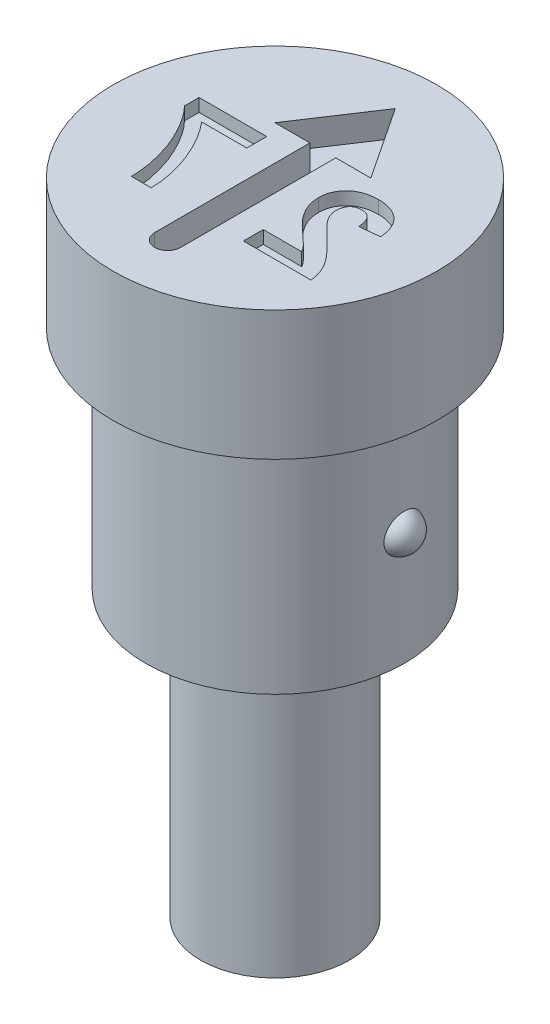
from build123d import *

# Parameters (mm, degrees)
CUT_EXTRUDE1_DEPTH = 0.4
CUT_EXTRUDE2_DEPTH = 0.2


with BuildPart() as part:
    # Sketch1 → Revolve1 (revolve)
    with BuildSketch(Plane.XY, mode=Mode.PRIVATE) as revolve1_sk:
        Polygon((0, 0), (-2.5, 0), (-2.5, -2), (-2, -2), (-2, -5.5), (-1.15, -5.5), (-1.15, -9.9), (0, -9.9), align=None)
    revolve(revolve1_sk.sketch.rotate(Axis((0, 0, 0), (0, -1, 0)), 270), axis=Axis((0, 0, 0), (0, -1, 0)))

    # Sketch3 → Cut-Extrude1 (cut)
    with BuildSketch(Plane(origin=(0, 0, 0), x_dir=(1, 0, 0), z_dir=(0, 1, 0))):
        with BuildLine():
            Line((0, 1.86), (-0.741311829, 0.74))
            Line((-0.741311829, 0.74), (-0.2, 0.74))
            Line((-0.2, 0.74), (-0.2, -1.66))
            ThreePointArc((-0.2, -1.66), (0, -1.86), (0.2, -1.66))
            Line((0.2, -1.66), (0.2, 0.74))
            Line((0.2, 0.74), (0.741311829, 0.74))
            Line((0.741311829, 0.74), (0, 1.86))
        make_face()
    extrude(amount=-CUT_EXTRUDE1_DEPTH, mode=Mode.SUBTRACT)

    # Sketch4 → Cut-Extrude2 (cut)
    with BuildSketch(Plane(origin=(0, 0, 0), x_dir=(1, 0, 0), z_dir=(0, 1, 0))):
        with BuildLine():
            Line((0.599086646, -0.780287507), (0.599086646, -1.087979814))
            Line((0.599086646, -1.087979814), (1.645240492, -1.087979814))
            add(Edge.make_bspline(
                [(1.645240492, -1.087979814), (1.641698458, -1.061683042), (1.634616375, -1.009104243), (1.612721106, -0.932299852), (1.583498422, -0.857351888), (1.551782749, -0.796362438), (1.520238, -0.747268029), (1.491617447, -0.707039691), (1.457474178, -0.664238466), (1.41830365, -0.61851883), (1.374322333, -0.569737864), (1.3252021, -0.518076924), (1.270708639, -0.463783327), (1.232371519, -0.426915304), (1.212548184, -0.407851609)],
                knots=[0, 0, 0, 0, 1.156289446, 2.311930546, 3.473459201, 4.661751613, 5.303057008, 6.018253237, 6.81459331, 7.690699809, 8.644447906, 9.679642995, 10.800191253, 12, 12, 12, 12], degree=3))
            add(Edge.make_bspline(
                [(1.212548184, -0.407851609), (1.196728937, -0.392581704), (1.166613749, -0.363512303), (1.123729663, -0.321886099), (1.086030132, -0.283619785), (1.052726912, -0.249705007), (1.024589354, -0.219278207), (1.001247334, -0.192817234), (0.982405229, -0.17021433), (0.972200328, -0.155875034), (0.96767639, -0.149518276)],
                knots=[0, 0, 0, 0, 1.480720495, 2.818855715, 4.024636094, 5.098235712, 6.019786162, 6.815086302, 7.474715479, 8, 8, 8, 8], degree=3))
            add(Edge.make_bspline(
                [(0.96767639, -0.149518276), (0.958412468, -0.134129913), (0.940543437, -0.104447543), (0.920948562, -0.057771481), (0.909186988, -0.01110506), (0.907572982, 0.020077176), (0.906778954, 0.035417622)],
                knots=[0, 0, 0, 0, 1.0911822, 2.104764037, 3.067617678, 4, 4, 4, 4], degree=3))
            add(Edge.make_bspline(
                [(0.906778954, 0.035417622), (0.90735522, 0.051381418), (0.908445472, 0.081583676), (0.917587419, 0.124204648), (0.933799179, 0.16084341), (0.956119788, 0.191612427), (0.984344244, 0.215719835), (1.017339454, 0.233532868), (1.055588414, 0.243381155), (1.08247204, 0.244676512), (1.096522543, 0.245353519)],
                knots=[0, 0, 0, 0, 1.193122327, 2.257294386, 3.237245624, 4.168877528, 5.075331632, 5.990371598, 6.949684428, 8, 8, 8, 8], degree=3))
            add(Edge.make_bspline(
                [(1.096522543, 0.245353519), (1.110478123, 0.244721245), (1.137437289, 0.243499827), (1.175752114, 0.232829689), (1.209270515, 0.214358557), (1.233157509, 0.193308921), (1.249294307, 0.172839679), (1.260289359, 0.155002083), (1.269766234, 0.134733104), (1.278163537, 0.112260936), (1.284796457, 0.087328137), (1.290138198, 0.060124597), (1.294442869, 0.03050392), (1.29581183, 0.009897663), (1.296522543, -0.000800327)],
                knots=[0, 0, 0, 0, 1.402788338, 2.709884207, 3.961032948, 5.225417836, 5.883680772, 6.578928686, 7.329201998, 8.132101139, 8.990263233, 9.922304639, 10.921339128, 12, 12, 12, 12], degree=3))
            Line((1.296522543, -0.000800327), (1.604214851, 0.029327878))
            add(Edge.make_bspline(
                [(1.604214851, 0.029327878), (1.601741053, 0.050100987), (1.596944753, 0.090376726), (1.584975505, 0.148226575), (1.569816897, 0.201595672), (1.550746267, 0.250384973), (1.528551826, 0.294904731), (1.502101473, 0.334486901), (1.472319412, 0.369569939), (1.439179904, 0.400135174), (1.402893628, 0.426279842), (1.364817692, 0.44961797), (1.324207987, 0.468762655), (1.281511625, 0.484540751), (1.236747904, 0.497150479), (1.189709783, 0.50548786), (1.140687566, 0.511352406), (1.107224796, 0.511794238), (1.090112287, 0.512020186)],
                knots=[0, 0, 0, 0, 1.270971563, 2.464210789, 3.586263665, 4.638946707, 5.643716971, 6.603612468, 7.52484387, 8.434700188, 9.336036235, 10.239171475, 11.145359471, 12.059630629, 13.003312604, 13.96741569, 14.960557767, 16, 16, 16, 16], degree=3))
            add(Edge.make_bspline(
                [(1.090112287, 0.512020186), (1.071508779, 0.511662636), (1.035276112, 0.510966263), (0.98238285, 0.505215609), (0.932693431, 0.49518851), (0.885773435, 0.481906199), (0.842104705, 0.464173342), (0.801323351, 0.442735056), (0.764071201, 0.416777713), (0.72979296, 0.387716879), (0.699150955, 0.355759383), (0.672311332, 0.321671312), (0.649825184, 0.285476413), (0.630955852, 0.247615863), (0.616945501, 0.20748043), (0.60673695, 0.165625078), (0.599968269, 0.121854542), (0.599383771, 0.091960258), (0.599086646, 0.076763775)],
                knots=[0, 0, 0, 0, 1.210756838, 2.35810096, 3.457354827, 4.507168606, 5.527358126, 6.519769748, 7.499700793, 8.476517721, 9.440526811, 10.376769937, 11.295256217, 12.209626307, 13.124630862, 14.055668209, 15.011616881, 16, 16, 16, 16], degree=3))
            add(Edge.make_bspline(
                [(0.599086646, 0.076763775), (0.599478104, 0.059323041), (0.600254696, 0.024723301), (0.607689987, -0.026425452), (0.619049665, -0.076394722), (0.635838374, -0.125306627), (0.657119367, -0.174334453), (0.684551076, -0.223588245), (0.716401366, -0.274553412), (0.741338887, -0.307504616), (0.754214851, -0.324518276)],
                knots=[0, 0, 0, 0, 0.953409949, 1.89141903, 2.821310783, 3.752688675, 4.715703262, 5.740811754, 6.833515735, 8, 8, 8, 8], degree=3))
            add(Edge.make_bspline(
                [(0.754214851, -0.324518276), (0.7590814, -0.330647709), (0.76950442, -0.343775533), (0.787236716, -0.363905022), (0.807786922, -0.38589277), (0.830864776, -0.410150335), (0.857232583, -0.435818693), (0.885941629, -0.463971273), (0.918255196, -0.493167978), (0.951724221, -0.524137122), (0.985338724, -0.554278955), (1.0162353, -0.582907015), (1.044299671, -0.608236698), (1.068224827, -0.631666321), (1.089418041, -0.651596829), (1.107115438, -0.669050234), (1.121648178, -0.683604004), (1.14167336, -0.706289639), (1.16715313, -0.736971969), (1.18507919, -0.766289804), (1.193637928, -0.780287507)],
                knots=[0, 0, 0, 0, 0.665555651, 1.425465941, 2.280616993, 3.225313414, 4.272635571, 5.410053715, 6.644756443, 7.976022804, 9.288331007, 10.484517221, 11.558462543, 12.503158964, 13.33222979, 14.032602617, 14.617328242, 15.080653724, 16.606167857, 18, 18, 18, 18], degree=3))
            Line((1.193637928, -0.780287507), (0.599086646, -0.780287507))
        make_face()
        with BuildLine():
            Line((-0.619374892, 0.183815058), (-0.619374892, 0.491507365))
            Line((-0.619374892, 0.491507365), (-1.665528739, 0.491507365))
            Line((-1.665528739, 0.491507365), (-1.665528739, 0.26586634))
            add(Edge.make_bspline(
                [(-1.665528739, 0.26586634), (-1.65461538, 0.254762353), (-1.632180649, 0.231935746), (-1.600045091, 0.194577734), (-1.567433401, 0.154037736), (-1.535027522, 0.109769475), (-1.501820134, 0.062472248), (-1.469270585, 0.011239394), (-1.436258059, -0.043264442), (-1.391812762, -0.120360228), (-1.339861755, -0.221071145), (-1.284900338, -0.346259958), (-1.238075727, -0.475293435), (-1.20601229, -0.58523947), (-1.184348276, -0.673361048), (-1.170194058, -0.737797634), (-1.15827921, -0.800420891), (-1.14858649, -0.861340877), (-1.141352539, -0.920585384), (-1.135636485, -0.977948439), (-1.132816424, -1.033569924), (-1.132400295, -1.07002862), (-1.132195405, -1.087979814)],
                knots=[0, 0, 0, 0, 0.628545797, 1.29210959, 1.98878689, 2.729126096, 3.507039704, 4.322017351, 5.179550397, 6.080149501, 7.915136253, 9.752312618, 11.597470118, 13.454141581, 14.373891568, 15.261584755, 16.117868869, 16.947726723, 17.752002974, 18.527724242, 19.275094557, 20, 20, 20, 20], degree=3))
            Line((-1.132195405, -1.087979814), (-0.824503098, -1.087979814))
            add(Edge.make_bspline(
                [(-0.824503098, -1.087979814), (-0.825531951, -1.060721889), (-0.827601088, -1.005903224), (-0.835342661, -0.923622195), (-0.847501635, -0.841034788), (-0.862603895, -0.757950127), (-0.882542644, -0.674570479), (-0.905298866, -0.59058698), (-0.932864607, -0.506448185), (-0.963765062, -0.422314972), (-0.997877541, -0.338986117), (-1.035055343, -0.25749517), (-1.075202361, -0.178350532), (-1.117796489, -0.101274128), (-1.163333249, -0.026513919), (-1.211846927, 0.045848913), (-1.262649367, 0.116337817), (-1.298973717, 0.161326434), (-1.317131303, 0.183815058)],
                knots=[0, 0, 0, 0, 0.943249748, 1.896978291, 2.856365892, 3.829648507, 4.816416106, 5.820376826, 6.838120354, 7.877341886, 8.919613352, 9.951365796, 10.974227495, 11.988073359, 12.996274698, 14.000568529, 15.000536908, 16, 16, 16, 16], degree=3))
            Line((-1.317131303, 0.183815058), (-0.619374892, 0.183815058))
        make_face()
    extrude(amount=-CUT_EXTRUDE2_DEPTH, mode=Mode.SUBTRACT)

    # Sketch5 → Revolve2 (revolve)
    with BuildSketch(Plane.XY):
        with BuildLine():
            Line((1.917379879, -3.45), (1.917379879, -4.05))
            ThreePointArc((1.917379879, -4.05), (2.217379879, -3.75), (1.917379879, -3.45))
        make_face()
    revolve(axis=Axis((1.917379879, -3.45, 0), (0, -1, 0)))


solid = part.part
